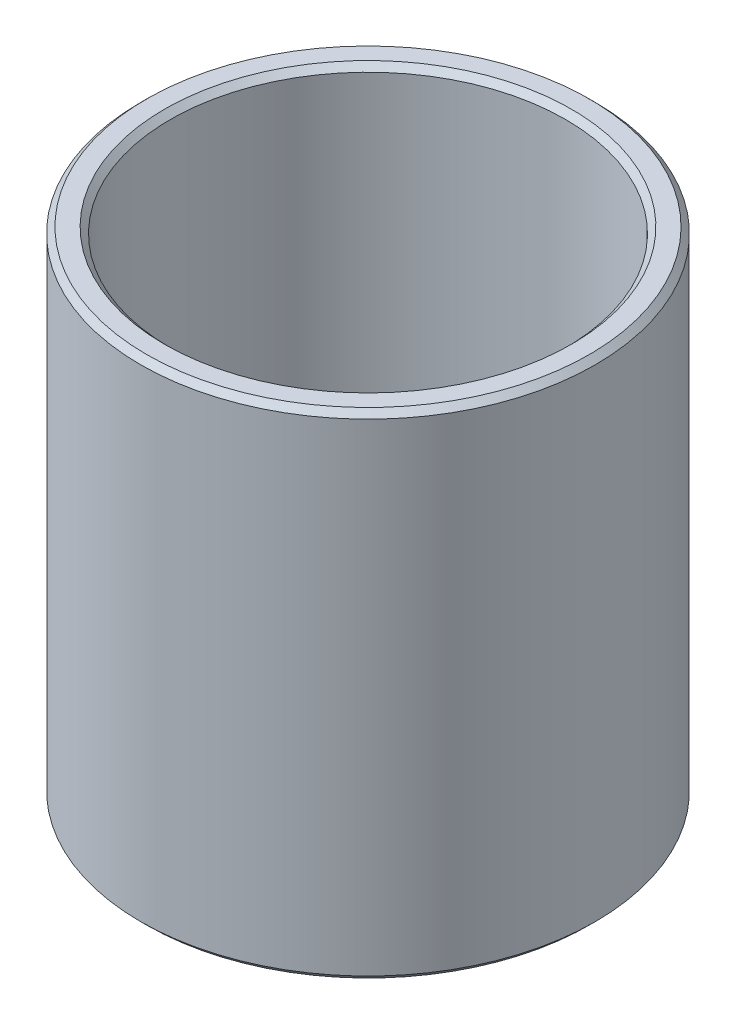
from build123d import *

# Parameters (mm, degrees)
SCHIZZO1_R                   = 11.5
SCHIZZO1_R_2                 = 10
ESTRUSIONE_ESTRUSIONE1_DEPTH = 25
SMUSSO1_SIZE                 = 0.3


with BuildPart() as part:
    # Schizzo1 → Estrusione-Estrusione1 (new body)
    with BuildSketch(Plane(origin=(0, 0, 0), x_dir=(1, 0, 0), z_dir=(0, 1, 0))):
        with Locations(Location((0, 0, 0), (0, 0, 270))):
            Circle(SCHIZZO1_R)
        with Locations(Location((0, 0, 0), (0, 0, 270))):
            Circle(SCHIZZO1_R_2, mode=Mode.SUBTRACT)
    extrude(amount=ESTRUSIONE_ESTRUSIONE1_DEPTH)

    # Smusso1
    smusso1_edges = [part.edges().sort_by_distance(p)[0] for p in [
        (0, 0, -11.5),
        (0, 25, -11.5),
        (0, 0, -10),
        (0, 25, -10),
    ]]
    chamfer(smusso1_edges, length=SMUSSO1_SIZE)


solid = part.part
